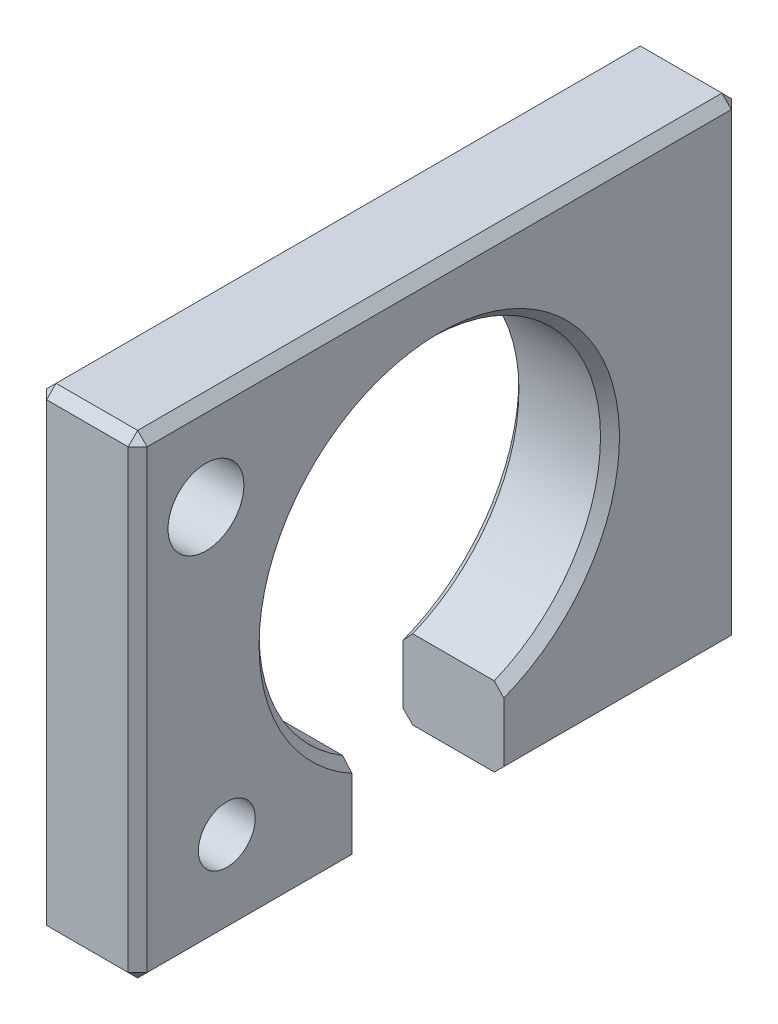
ISO-10303-21;
HEADER;
FILE_DESCRIPTION(('STEP AP214'),'2;1');
FILE_NAME('part.step','',(''),(''),'','','');
FILE_SCHEMA(('AUTOMOTIVE_DESIGN { 1 0 10303 214 1 1 1 1 }'));
ENDSEC;
DATA;
#1=APPLICATION_CONTEXT('core data for automotive mechanical design processes');
#2=APPLICATION_PROTOCOL_DEFINITION('international standard','automotive_design',2000,#1);
#3=PRODUCT_CONTEXT('',#1,'mechanical');
#4=PRODUCT('Part','Part','',(#3));
#5=PRODUCT_RELATED_PRODUCT_CATEGORY('part','',(#4));
#6=PRODUCT_DEFINITION_FORMATION('','',#4);
#7=PRODUCT_DEFINITION_CONTEXT('part definition',#1,'design');
#8=PRODUCT_DEFINITION('design','',#6,#7);
#9=PRODUCT_DEFINITION_SHAPE('','',#8);
#10=(LENGTH_UNIT() NAMED_UNIT(*) SI_UNIT(.MILLI.,.METRE.));
#11=(NAMED_UNIT(*) PLANE_ANGLE_UNIT() SI_UNIT($,.RADIAN.));
#12=(NAMED_UNIT(*) SI_UNIT($,.STERADIAN.) SOLID_ANGLE_UNIT());
#13=UNCERTAINTY_MEASURE_WITH_UNIT(LENGTH_MEASURE(1.E-05),#10,'distance_accuracy_value','');
#14=(GEOMETRIC_REPRESENTATION_CONTEXT(3) GLOBAL_UNCERTAINTY_ASSIGNED_CONTEXT((#13)) GLOBAL_UNIT_ASSIGNED_CONTEXT((#10,
#11,#12)) REPRESENTATION_CONTEXT('',''));
#15=CARTESIAN_POINT('',(0.,0.,0.));
#16=DIRECTION('',(0.,0.,1.));
#17=DIRECTION('',(1.,0.,0.));
#18=AXIS2_PLACEMENT_3D('',#15,#16,#17);
#19=CARTESIAN_POINT('',(2.65,12.5,15.9));
#20=DIRECTION('',(0.,0.,-1.));
#21=DIRECTION('',(-1.,0.,0.));
#22=AXIS2_PLACEMENT_3D('',#19,#20,#21);
#23=PLANE('',#22);
#24=DIRECTION('',(1.,0.,0.));
#25=VECTOR('',#24,1.);
#26=CARTESIAN_POINT('',(2.65,-12.,15.9));
#27=LINE('',#26,#25);
#28=CARTESIAN_POINT('',(-2.15,-12.,15.9));
#29=VERTEX_POINT('',#28);
#30=CARTESIAN_POINT('',(2.15,-12.,15.9));
#31=VERTEX_POINT('',#30);
#32=EDGE_CURVE('E352',#29,#31,#27,.T.);
#33=ORIENTED_EDGE('',*,*,#32,.T.);
#34=DIRECTION('',(0.,1.,0.));
#35=VECTOR('',#34,1.);
#36=CARTESIAN_POINT('',(2.15,12.5,15.9));
#37=LINE('',#36,#35);
#38=CARTESIAN_POINT('',(2.15,12.,15.9));
#39=VERTEX_POINT('',#38);
#40=EDGE_CURVE('E354',#31,#39,#37,.T.);
#41=ORIENTED_EDGE('',*,*,#40,.T.);
#42=DIRECTION('',(-1.,0.,0.));
#43=VECTOR('',#42,1.);
#44=CARTESIAN_POINT('',(2.65,12.,15.9));
#45=LINE('',#44,#43);
#46=CARTESIAN_POINT('',(-2.15,12.,15.9));
#47=VERTEX_POINT('',#46);
#48=EDGE_CURVE('E342',#39,#47,#45,.T.);
#49=ORIENTED_EDGE('',*,*,#48,.T.);
#50=DIRECTION('',(0.,-1.,0.));
#51=VECTOR('',#50,1.);
#52=CARTESIAN_POINT('',(-2.15,12.5,15.9));
#53=LINE('',#52,#51);
#54=EDGE_CURVE('E345',#47,#29,#53,.T.);
#55=ORIENTED_EDGE('',*,*,#54,.T.);
#56=EDGE_LOOP('',(#33,#41,#49,#55));
#57=FACE_BOUND('',#56,.T.);
#58=ADVANCED_FACE('F33',(#57),#23,.F.);
#59=CARTESIAN_POINT('',(2.65,-12.5,15.9));
#60=DIRECTION('',(0.,1.,0.));
#61=DIRECTION('',(0.,0.,1.));
#62=AXIS2_PLACEMENT_3D('',#59,#60,#61);
#63=PLANE('',#62);
#64=DIRECTION('',(-1.,0.,0.));
#65=VECTOR('',#64,1.);
#66=CARTESIAN_POINT('',(2.65,-12.5,4.59999999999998));
#67=LINE('',#66,#65);
#68=CARTESIAN_POINT('',(2.15,-12.5,4.59999999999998));
#69=VERTEX_POINT('',#68);
#70=CARTESIAN_POINT('',(-2.15,-12.5,4.59999999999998));
#71=VERTEX_POINT('',#70);
#72=EDGE_CURVE('E314',#69,#71,#67,.T.);
#73=ORIENTED_EDGE('',*,*,#72,.F.);
#74=DIRECTION('',(0.,0.,1.));
#75=VECTOR('',#74,1.);
#76=CARTESIAN_POINT('',(2.15,-12.5,15.9));
#77=LINE('',#76,#75);
#78=CARTESIAN_POINT('',(2.15,-12.5,15.4));
#79=VERTEX_POINT('',#78);
#80=EDGE_CURVE('E197',#69,#79,#77,.T.);
#81=ORIENTED_EDGE('',*,*,#80,.T.);
#82=DIRECTION('',(-1.,0.,0.));
#83=VECTOR('',#82,1.);
#84=CARTESIAN_POINT('',(2.65,-12.5,15.4));
#85=LINE('',#84,#83);
#86=CARTESIAN_POINT('',(-2.15,-12.5,15.4));
#87=VERTEX_POINT('',#86);
#88=EDGE_CURVE('E359',#79,#87,#85,.T.);
#89=ORIENTED_EDGE('',*,*,#88,.T.);
#90=DIRECTION('',(0.,0.,-1.));
#91=VECTOR('',#90,1.);
#92=CARTESIAN_POINT('',(-2.15,-12.5,15.9));
#93=LINE('',#92,#91);
#94=EDGE_CURVE('E357',#87,#71,#93,.T.);
#95=ORIENTED_EDGE('',*,*,#94,.T.);
#96=EDGE_LOOP('',(#73,#81,#89,#95));
#97=FACE_BOUND('',#96,.T.);
#98=ADVANCED_FACE('F224',(#97),#63,.F.);
#99=CARTESIAN_POINT('',(2.65,-7.73563184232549,4.59999999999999));
#100=DIRECTION('',(0.,0.,1.));
#101=DIRECTION('',(0.,-1.,0.));
#102=AXIS2_PLACEMENT_3D('',#99,#100,#101);
#103=PLANE('',#102);
#104=DIRECTION('',(-1.,0.,0.));
#105=VECTOR('',#104,1.);
#106=CARTESIAN_POINT('',(2.65,-7.7356318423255,4.59999999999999));
#107=LINE('',#106,#105);
#108=CARTESIAN_POINT('',(2.15,-7.7356318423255,4.59999999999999));
#109=VERTEX_POINT('',#108);
#110=CARTESIAN_POINT('',(-2.15,-7.7356318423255,4.59999999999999));
#111=VERTEX_POINT('',#110);
#112=EDGE_CURVE('E311',#109,#111,#107,.T.);
#113=ORIENTED_EDGE('',*,*,#112,.F.);
#114=CARTESIAN_POINT('',(2.15,-7.7356318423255,4.59999999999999));
#115=CARTESIAN_POINT('',(2.23291053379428,-7.83206655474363,4.59999999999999));
#116=CARTESIAN_POINT('',(2.31603247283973,-7.92831788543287,4.59999999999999));
#117=CARTESIAN_POINT('',(2.48269913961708,-8.12045375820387,4.59999999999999));
#118=CARTESIAN_POINT('',(2.5662438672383,-8.21633830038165,4.59999999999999));
#119=CARTESIAN_POINT('',(2.65,-8.31203946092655,4.59999999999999));
#120=B_SPLINE_CURVE_WITH_KNOTS('',3,(#114,#115,#116,#117,#118,#119),.UNSPECIFIED.,.F.,.F.,(4,2,
4),(0.,0.381526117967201,0.763052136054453),.UNSPECIFIED.);
#121=CARTESIAN_POINT('',(2.65,-8.31203946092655,4.59999999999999));
#122=VERTEX_POINT('',#121);
#123=EDGE_CURVE('E191',#109,#122,#120,.T.);
#124=ORIENTED_EDGE('',*,*,#123,.T.);
#125=DIRECTION('',(0.,1.,0.));
#126=VECTOR('',#125,1.);
#127=CARTESIAN_POINT('',(2.65,-7.73563184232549,4.59999999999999));
#128=LINE('',#127,#126);
#129=CARTESIAN_POINT('',(2.65,-12.,4.59999999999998));
#130=VERTEX_POINT('',#129);
#131=EDGE_CURVE('E175',#130,#122,#128,.T.);
#132=ORIENTED_EDGE('',*,*,#131,.F.);
#133=DIRECTION('',(-0.707106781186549,-0.707106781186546,0.));
#134=VECTOR('',#133,1.);
#135=CARTESIAN_POINT('',(2.65,-12.,4.59999999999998));
#136=LINE('',#135,#134);
#137=EDGE_CURVE('E188',#130,#69,#136,.T.);
#138=ORIENTED_EDGE('',*,*,#137,.T.);
#139=ORIENTED_EDGE('',*,*,#72,.T.);
#140=DIRECTION('',(0.707106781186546,-0.707106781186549,0.));
#141=VECTOR('',#140,1.);
#142=CARTESIAN_POINT('',(-2.15,-12.5,4.59999999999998));
#143=LINE('',#142,#141);
#144=CARTESIAN_POINT('',(-2.65,-12.,4.59999999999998));
#145=VERTEX_POINT('',#144);
#146=EDGE_CURVE('E199',#71,#145,#143,.F.);
#147=ORIENTED_EDGE('',*,*,#146,.T.);
#148=DIRECTION('',(0.,1.,0.));
#149=VECTOR('',#148,1.);
#150=CARTESIAN_POINT('',(-2.65,-7.73563184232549,4.59999999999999));
#151=LINE('',#150,#149);
#152=CARTESIAN_POINT('',(-2.65,-8.31203946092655,4.59999999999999));
#153=VERTEX_POINT('',#152);
#154=EDGE_CURVE('E298',#145,#153,#151,.T.);
#155=ORIENTED_EDGE('',*,*,#154,.T.);
#156=CARTESIAN_POINT('',(-2.65,-8.31203946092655,4.59999999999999));
#157=CARTESIAN_POINT('',(-2.5662438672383,-8.21633830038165,4.59999999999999));
#158=CARTESIAN_POINT('',(-2.48269913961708,-8.12045375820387,4.59999999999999));
#159=CARTESIAN_POINT('',(-2.31603247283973,-7.92831788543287,4.59999999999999));
#160=CARTESIAN_POINT('',(-2.23291053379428,-7.83206655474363,4.59999999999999));
#161=CARTESIAN_POINT('',(-2.15,-7.7356318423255,4.59999999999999));
#162=B_SPLINE_CURVE_WITH_KNOTS('',3,(#156,#157,#158,#159,#160,#161),.UNSPECIFIED.,.F.,.F.,(4,2,
4),(0.,0.381526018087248,0.763052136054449),.UNSPECIFIED.);
#163=EDGE_CURVE('E198',#153,#111,#162,.T.);
#164=ORIENTED_EDGE('',*,*,#163,.T.);
#165=EDGE_LOOP('',(#113,#124,#132,#138,#139,#147,#155,#164));
#166=FACE_BOUND('',#165,.T.);
#167=ADVANCED_FACE('F186',(#166),#103,.F.);
#168=CARTESIAN_POINT('',(2.65,0.,0.));
#169=DIRECTION('',(-1.,0.,0.));
#170=DIRECTION('',(0.,0.,1.));
#171=AXIS2_PLACEMENT_3D('',#168,#169,#170);
#172=CYLINDRICAL_SURFACE('',#171,9.);
#173=DIRECTION('',(-1.,0.,0.));
#174=VECTOR('',#173,1.);
#175=CARTESIAN_POINT('',(2.65,-8.33306666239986,-3.40000000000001));
#176=LINE('',#175,#174);
#177=CARTESIAN_POINT('',(2.15,-8.33306666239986,-3.40000000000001));
#178=VERTEX_POINT('',#177);
#179=CARTESIAN_POINT('',(-2.15,-8.33306666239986,-3.40000000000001));
#180=VERTEX_POINT('',#179);
#181=EDGE_CURVE('E308',#178,#180,#176,.T.);
#182=ORIENTED_EDGE('',*,*,#181,.F.);
#183=CARTESIAN_POINT('',(2.15,0.,0.));
#184=DIRECTION('',(1.,0.,0.));
#185=DIRECTION('',(0.,0.,-1.));
#186=AXIS2_PLACEMENT_3D('',#183,#184,#185);
#187=CIRCLE('',#186,9.);
#188=EDGE_CURVE('E202',#178,#109,#187,.T.);
#189=ORIENTED_EDGE('',*,*,#188,.T.);
#190=ORIENTED_EDGE('',*,*,#112,.T.);
#191=CARTESIAN_POINT('',(-2.15,0.,0.));
#192=DIRECTION('',(1.,0.,0.));
#193=DIRECTION('',(0.,0.,-1.));
#194=AXIS2_PLACEMENT_3D('',#191,#192,#193);
#195=CIRCLE('',#194,9.);
#196=EDGE_CURVE('E245',#111,#180,#195,.F.);
#197=ORIENTED_EDGE('',*,*,#196,.T.);
#198=EDGE_LOOP('',(#182,#189,#190,#197));
#199=FACE_BOUND('',#198,.T.);
#200=ADVANCED_FACE('F223',(#199),#172,.F.);
#201=CARTESIAN_POINT('',(2.65,-8.33306666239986,-3.40000000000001));
#202=DIRECTION('',(0.,0.,-1.));
#203=DIRECTION('',(-1.,0.,0.));
#204=AXIS2_PLACEMENT_3D('',#201,#202,#203);
#205=PLANE('',#204);
#206=DIRECTION('',(0.,-1.,0.));
#207=VECTOR('',#206,1.);
#208=CARTESIAN_POINT('',(2.65,-8.33306666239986,-3.40000000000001));
#209=LINE('',#208,#207);
#210=CARTESIAN_POINT('',(2.65,-8.87073841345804,-3.40000000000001));
#211=VERTEX_POINT('',#210);
#212=CARTESIAN_POINT('',(2.65,-12.,-3.40000000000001));
#213=VERTEX_POINT('',#212);
#214=EDGE_CURVE('E192',#211,#213,#209,.T.);
#215=ORIENTED_EDGE('',*,*,#214,.F.);
#216=CARTESIAN_POINT('',(2.65,-8.87073841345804,-3.40000000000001));
#217=CARTESIAN_POINT('',(2.56647781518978,-8.78130207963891,-3.40000000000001));
#218=CARTESIAN_POINT('',(2.48305005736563,-8.69177793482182,-3.40000000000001));
#219=CARTESIAN_POINT('',(2.31638339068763,-8.51255401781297,-3.40000000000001));
#220=CARTESIAN_POINT('',(2.23314448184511,-8.42285424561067,-3.40000000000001));
#221=CARTESIAN_POINT('',(2.15,-8.33306666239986,-3.40000000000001));
#222=B_SPLINE_CURVE_WITH_KNOTS('',3,(#216,#217,#218,#219,#220,#221),.UNSPECIFIED.,.F.,.F.,(4,2,
4),(0.,0.367114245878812,0.734228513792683),.UNSPECIFIED.);
#223=EDGE_CURVE('E239',#211,#178,#222,.T.);
#224=ORIENTED_EDGE('',*,*,#223,.T.);
#225=ORIENTED_EDGE('',*,*,#181,.T.);
#226=CARTESIAN_POINT('',(-2.15,-8.33306666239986,-3.40000000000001));
#227=CARTESIAN_POINT('',(-2.23314448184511,-8.42285424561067,-3.40000000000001));
#228=CARTESIAN_POINT('',(-2.31638339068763,-8.51255401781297,-3.40000000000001));
#229=CARTESIAN_POINT('',(-2.48305005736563,-8.69177793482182,-3.40000000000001));
#230=CARTESIAN_POINT('',(-2.56647781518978,-8.78130207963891,-3.40000000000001));
#231=CARTESIAN_POINT('',(-2.65,-8.87073841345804,-3.40000000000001));
#232=B_SPLINE_CURVE_WITH_KNOTS('',3,(#226,#227,#228,#229,#230,#231),.UNSPECIFIED.,.F.,.F.,(4,2,
4),(0.,0.36711426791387,0.734228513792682),.UNSPECIFIED.);
#233=CARTESIAN_POINT('',(-2.65,-8.87073841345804,-3.40000000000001));
#234=VERTEX_POINT('',#233);
#235=EDGE_CURVE('E246',#180,#234,#232,.T.);
#236=ORIENTED_EDGE('',*,*,#235,.T.);
#237=DIRECTION('',(0.,-1.,0.));
#238=VECTOR('',#237,1.);
#239=CARTESIAN_POINT('',(-2.65,-8.33306666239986,-3.40000000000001));
#240=LINE('',#239,#238);
#241=CARTESIAN_POINT('',(-2.65,-12.,-3.40000000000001));
#242=VERTEX_POINT('',#241);
#243=EDGE_CURVE('E193',#234,#242,#240,.T.);
#244=ORIENTED_EDGE('',*,*,#243,.T.);
#245=DIRECTION('',(-0.707106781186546,0.707106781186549,0.));
#246=VECTOR('',#245,1.);
#247=CARTESIAN_POINT('',(-2.15,-12.5,-3.40000000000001));
#248=LINE('',#247,#246);
#249=CARTESIAN_POINT('',(-2.15,-12.5,-3.40000000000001));
#250=VERTEX_POINT('',#249);
#251=EDGE_CURVE('E324',#242,#250,#248,.F.);
#252=ORIENTED_EDGE('',*,*,#251,.T.);
#253=DIRECTION('',(-1.,0.,0.));
#254=VECTOR('',#253,1.);
#255=CARTESIAN_POINT('',(2.65,-12.5,-3.40000000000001));
#256=LINE('',#255,#254);
#257=CARTESIAN_POINT('',(2.15,-12.5,-3.40000000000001));
#258=VERTEX_POINT('',#257);
#259=EDGE_CURVE('E302',#258,#250,#256,.T.);
#260=ORIENTED_EDGE('',*,*,#259,.F.);
#261=DIRECTION('',(0.707106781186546,0.707106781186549,0.));
#262=VECTOR('',#261,1.);
#263=CARTESIAN_POINT('',(2.65,-12.,-3.40000000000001));
#264=LINE('',#263,#262);
#265=EDGE_CURVE('E325',#258,#213,#264,.T.);
#266=ORIENTED_EDGE('',*,*,#265,.T.);
#267=EDGE_LOOP('',(#215,#224,#225,#236,#244,#252,#260,#266));
#268=FACE_BOUND('',#267,.T.);
#269=ADVANCED_FACE('F251',(#268),#205,.F.);
#270=CARTESIAN_POINT('',(2.65,-12.5,-3.40000000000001));
#271=DIRECTION('',(0.,1.,0.));
#272=DIRECTION('',(0.,0.,1.));
#273=AXIS2_PLACEMENT_3D('',#270,#271,#272);
#274=PLANE('',#273);
#275=DIRECTION('',(1.,0.,0.));
#276=VECTOR('',#275,1.);
#277=CARTESIAN_POINT('',(2.65,-12.5,-15.4));
#278=LINE('',#277,#276);
#279=CARTESIAN_POINT('',(-2.15,-12.5,-15.4));
#280=VERTEX_POINT('',#279);
#281=CARTESIAN_POINT('',(2.15,-12.5,-15.4));
#282=VERTEX_POINT('',#281);
#283=EDGE_CURVE('E42',#280,#282,#278,.T.);
#284=ORIENTED_EDGE('',*,*,#283,.T.);
#285=DIRECTION('',(0.,0.,1.));
#286=VECTOR('',#285,1.);
#287=CARTESIAN_POINT('',(2.15,-12.5,-3.40000000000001));
#288=LINE('',#287,#286);
#289=EDGE_CURVE('E11',#282,#258,#288,.T.);
#290=ORIENTED_EDGE('',*,*,#289,.T.);
#291=ORIENTED_EDGE('',*,*,#259,.T.);
#292=DIRECTION('',(0.,0.,-1.));
#293=VECTOR('',#292,1.);
#294=CARTESIAN_POINT('',(-2.15,-12.5,-3.40000000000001));
#295=LINE('',#294,#293);
#296=EDGE_CURVE('E53',#250,#280,#295,.T.);
#297=ORIENTED_EDGE('',*,*,#296,.T.);
#298=EDGE_LOOP('',(#284,#290,#291,#297));
#299=FACE_BOUND('',#298,.T.);
#300=ADVANCED_FACE('F255',(#299),#274,.F.);
#301=CARTESIAN_POINT('',(2.65,12.5,-15.9));
#302=DIRECTION('',(0.,0.,1.));
#303=DIRECTION('',(1.,0.,0.));
#304=AXIS2_PLACEMENT_3D('',#301,#302,#303);
#305=PLANE('',#304);
#306=DIRECTION('',(0.,-1.,0.));
#307=VECTOR('',#306,1.);
#308=CARTESIAN_POINT('',(2.15,-12.5,-15.9));
#309=LINE('',#308,#307);
#310=CARTESIAN_POINT('',(2.15,12.,-15.9));
#311=VERTEX_POINT('',#310);
#312=CARTESIAN_POINT('',(2.15,-12.,-15.9));
#313=VERTEX_POINT('',#312);
#314=EDGE_CURVE('E375',#311,#313,#309,.T.);
#315=ORIENTED_EDGE('',*,*,#314,.T.);
#316=DIRECTION('',(-1.,0.,0.));
#317=VECTOR('',#316,1.);
#318=CARTESIAN_POINT('',(2.65,-12.,-15.9));
#319=LINE('',#318,#317);
#320=CARTESIAN_POINT('',(-2.15,-12.,-15.9));
#321=VERTEX_POINT('',#320);
#322=EDGE_CURVE('E377',#313,#321,#319,.T.);
#323=ORIENTED_EDGE('',*,*,#322,.T.);
#324=DIRECTION('',(0.,1.,0.));
#325=VECTOR('',#324,1.);
#326=CARTESIAN_POINT('',(-2.15,12.5,-15.9));
#327=LINE('',#326,#325);
#328=CARTESIAN_POINT('',(-2.15,12.,-15.9));
#329=VERTEX_POINT('',#328);
#330=EDGE_CURVE('E371',#321,#329,#327,.T.);
#331=ORIENTED_EDGE('',*,*,#330,.T.);
#332=DIRECTION('',(1.,0.,0.));
#333=VECTOR('',#332,1.);
#334=CARTESIAN_POINT('',(2.65,12.,-15.9));
#335=LINE('',#334,#333);
#336=EDGE_CURVE('E373',#329,#311,#335,.T.);
#337=ORIENTED_EDGE('',*,*,#336,.T.);
#338=EDGE_LOOP('',(#315,#323,#331,#337));
#339=FACE_BOUND('',#338,.T.);
#340=ADVANCED_FACE('F260',(#339),#305,.F.);
#341=CARTESIAN_POINT('',(2.65,12.5,15.9));
#342=DIRECTION('',(0.,-1.,0.));
#343=DIRECTION('',(0.,0.,-1.));
#344=AXIS2_PLACEMENT_3D('',#341,#342,#343);
#345=PLANE('',#344);
#346=DIRECTION('',(1.,0.,0.));
#347=VECTOR('',#346,1.);
#348=CARTESIAN_POINT('',(2.65,12.5,15.4));
#349=LINE('',#348,#347);
#350=CARTESIAN_POINT('',(-2.15,12.5,15.4));
#351=VERTEX_POINT('',#350);
#352=CARTESIAN_POINT('',(2.15,12.5,15.4));
#353=VERTEX_POINT('',#352);
#354=EDGE_CURVE('E366',#351,#353,#349,.T.);
#355=ORIENTED_EDGE('',*,*,#354,.T.);
#356=DIRECTION('',(0.,0.,-1.));
#357=VECTOR('',#356,1.);
#358=CARTESIAN_POINT('',(2.15,12.5,-15.9));
#359=LINE('',#358,#357);
#360=CARTESIAN_POINT('',(2.15,12.5,-15.4));
#361=VERTEX_POINT('',#360);
#362=EDGE_CURVE('E368',#353,#361,#359,.T.);
#363=ORIENTED_EDGE('',*,*,#362,.T.);
#364=DIRECTION('',(-1.,0.,0.));
#365=VECTOR('',#364,1.);
#366=CARTESIAN_POINT('',(2.65,12.5,-15.4));
#367=LINE('',#366,#365);
#368=CARTESIAN_POINT('',(-2.15,12.5,-15.4));
#369=VERTEX_POINT('',#368);
#370=EDGE_CURVE('E362',#361,#369,#367,.T.);
#371=ORIENTED_EDGE('',*,*,#370,.T.);
#372=DIRECTION('',(0.,0.,1.));
#373=VECTOR('',#372,1.);
#374=CARTESIAN_POINT('',(-2.15,12.5,15.9));
#375=LINE('',#374,#373);
#376=EDGE_CURVE('E364',#369,#351,#375,.T.);
#377=ORIENTED_EDGE('',*,*,#376,.T.);
#378=EDGE_LOOP('',(#355,#363,#371,#377));
#379=FACE_BOUND('',#378,.T.);
#380=ADVANCED_FACE('F263',(#379),#345,.F.);
#381=CARTESIAN_POINT('',(2.65,0.,0.));
#382=DIRECTION('',(1.,0.,0.));
#383=DIRECTION('',(0.,0.,-1.));
#384=AXIS2_PLACEMENT_3D('',#381,#382,#383);
#385=PLANE('',#384);
#386=CARTESIAN_POINT('',(2.65,7.7,12.3));
#387=DIRECTION('',(1.,0.,0.));
#388=DIRECTION('',(0.,0.,-1.));
#389=AXIS2_PLACEMENT_3D('',#386,#387,#388);
#390=CIRCLE('',#389,2.);
#391=CARTESIAN_POINT('',(2.65,7.7,10.3));
#392=VERTEX_POINT('',#391);
#393=EDGE_CURVE('E286',#392,#392,#390,.T.);
#394=ORIENTED_EDGE('',*,*,#393,.F.);
#395=EDGE_LOOP('',(#394));
#396=FACE_BOUND('',#395,.T.);
#397=CARTESIAN_POINT('',(2.65,-7.8,11.2));
#398=DIRECTION('',(1.,0.,0.));
#399=DIRECTION('',(0.,0.,-1.));
#400=AXIS2_PLACEMENT_3D('',#397,#398,#399);
#401=CIRCLE('',#400,1.5);
#402=CARTESIAN_POINT('',(2.65,-7.8,9.7));
#403=VERTEX_POINT('',#402);
#404=EDGE_CURVE('E290',#403,#403,#401,.T.);
#405=ORIENTED_EDGE('',*,*,#404,.F.);
#406=EDGE_LOOP('',(#405));
#407=FACE_BOUND('',#406,.T.);
#408=ORIENTED_EDGE('',*,*,#131,.T.);
#409=CARTESIAN_POINT('',(2.65,0.,0.));
#410=DIRECTION('',(1.,0.,0.));
#411=DIRECTION('',(0.,0.,-1.));
#412=AXIS2_PLACEMENT_3D('',#409,#410,#411);
#413=CIRCLE('',#412,9.5);
#414=EDGE_CURVE('E182',#122,#211,#413,.F.);
#415=ORIENTED_EDGE('',*,*,#414,.T.);
#416=ORIENTED_EDGE('',*,*,#214,.T.);
#417=DIRECTION('',(0.,0.,-1.));
#418=VECTOR('',#417,1.);
#419=CARTESIAN_POINT('',(2.65,-12.,-15.9));
#420=LINE('',#419,#418);
#421=CARTESIAN_POINT('',(2.65,-12.,-15.4));
#422=VERTEX_POINT('',#421);
#423=EDGE_CURVE('E318',#213,#422,#420,.T.);
#424=ORIENTED_EDGE('',*,*,#423,.T.);
#425=DIRECTION('',(0.,1.,0.));
#426=VECTOR('',#425,1.);
#427=CARTESIAN_POINT('',(2.65,12.5,-15.4));
#428=LINE('',#427,#426);
#429=CARTESIAN_POINT('',(2.65,12.,-15.4));
#430=VERTEX_POINT('',#429);
#431=EDGE_CURVE('E316',#422,#430,#428,.T.);
#432=ORIENTED_EDGE('',*,*,#431,.T.);
#433=DIRECTION('',(0.,0.,1.));
#434=VECTOR('',#433,1.);
#435=CARTESIAN_POINT('',(2.65,12.,15.9));
#436=LINE('',#435,#434);
#437=CARTESIAN_POINT('',(2.65,12.,15.4));
#438=VERTEX_POINT('',#437);
#439=EDGE_CURVE('E320',#430,#438,#436,.T.);
#440=ORIENTED_EDGE('',*,*,#439,.T.);
#441=DIRECTION('',(0.,-1.,0.));
#442=VECTOR('',#441,1.);
#443=CARTESIAN_POINT('',(2.65,-12.5,15.4));
#444=LINE('',#443,#442);
#445=CARTESIAN_POINT('',(2.65,-12.,15.4));
#446=VERTEX_POINT('',#445);
#447=EDGE_CURVE('E178',#438,#446,#444,.T.);
#448=ORIENTED_EDGE('',*,*,#447,.T.);
#449=DIRECTION('',(0.,0.,-1.));
#450=VECTOR('',#449,1.);
#451=CARTESIAN_POINT('',(2.65,-12.,4.59999999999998));
#452=LINE('',#451,#450);
#453=EDGE_CURVE('E171',#446,#130,#452,.T.);
#454=ORIENTED_EDGE('',*,*,#453,.T.);
#455=EDGE_LOOP('',(#408,#415,#416,#424,#432,#440,#448,#454));
#456=FACE_BOUND('',#455,.T.);
#457=ADVANCED_FACE('F173',(#396,#407,#456),#385,.T.);
#458=CARTESIAN_POINT('',(-2.65,0.,0.));
#459=DIRECTION('',(1.,0.,0.));
#460=DIRECTION('',(0.,0.,-1.));
#461=AXIS2_PLACEMENT_3D('',#458,#459,#460);
#462=PLANE('',#461);
#463=CARTESIAN_POINT('',(-2.65,7.7,12.3));
#464=DIRECTION('',(1.,0.,0.));
#465=DIRECTION('',(0.,0.,-1.));
#466=AXIS2_PLACEMENT_3D('',#463,#464,#465);
#467=CIRCLE('',#466,2.);
#468=CARTESIAN_POINT('',(-2.65,7.7,10.3));
#469=VERTEX_POINT('',#468);
#470=EDGE_CURVE('E289',#469,#469,#467,.F.);
#471=ORIENTED_EDGE('',*,*,#470,.F.);
#472=EDGE_LOOP('',(#471));
#473=FACE_BOUND('',#472,.T.);
#474=CARTESIAN_POINT('',(-2.65,-7.8,11.2));
#475=DIRECTION('',(1.,0.,0.));
#476=DIRECTION('',(0.,0.,-1.));
#477=AXIS2_PLACEMENT_3D('',#474,#475,#476);
#478=CIRCLE('',#477,1.5);
#479=CARTESIAN_POINT('',(-2.65,-7.8,9.7));
#480=VERTEX_POINT('',#479);
#481=EDGE_CURVE('E293',#480,#480,#478,.F.);
#482=ORIENTED_EDGE('',*,*,#481,.F.);
#483=EDGE_LOOP('',(#482));
#484=FACE_BOUND('',#483,.T.);
#485=ORIENTED_EDGE('',*,*,#243,.F.);
#486=CARTESIAN_POINT('',(-2.65,0.,0.));
#487=DIRECTION('',(1.,0.,0.));
#488=DIRECTION('',(0.,0.,-1.));
#489=AXIS2_PLACEMENT_3D('',#486,#487,#488);
#490=CIRCLE('',#489,9.5);
#491=EDGE_CURVE('E338',#234,#153,#490,.T.);
#492=ORIENTED_EDGE('',*,*,#491,.T.);
#493=ORIENTED_EDGE('',*,*,#154,.F.);
#494=DIRECTION('',(0.,0.,1.));
#495=VECTOR('',#494,1.);
#496=CARTESIAN_POINT('',(-2.65,-12.,0.));
#497=LINE('',#496,#495);
#498=CARTESIAN_POINT('',(-2.65,-12.,15.4));
#499=VERTEX_POINT('',#498);
#500=EDGE_CURVE('E343',#145,#499,#497,.T.);
#501=ORIENTED_EDGE('',*,*,#500,.T.);
#502=DIRECTION('',(0.,1.,0.));
#503=VECTOR('',#502,1.);
#504=CARTESIAN_POINT('',(-2.65,0.,15.4));
#505=LINE('',#504,#503);
#506=CARTESIAN_POINT('',(-2.65,12.,15.4));
#507=VERTEX_POINT('',#506);
#508=EDGE_CURVE('E347',#499,#507,#505,.T.);
#509=ORIENTED_EDGE('',*,*,#508,.T.);
#510=DIRECTION('',(0.,0.,-1.));
#511=VECTOR('',#510,1.);
#512=CARTESIAN_POINT('',(-2.65,12.,0.));
#513=LINE('',#512,#511);
#514=CARTESIAN_POINT('',(-2.65,12.,-15.4));
#515=VERTEX_POINT('',#514);
#516=EDGE_CURVE('E455',#507,#515,#513,.T.);
#517=ORIENTED_EDGE('',*,*,#516,.T.);
#518=DIRECTION('',(0.,-1.,0.));
#519=VECTOR('',#518,1.);
#520=CARTESIAN_POINT('',(-2.65,0.,-15.4));
#521=LINE('',#520,#519);
#522=CARTESIAN_POINT('',(-2.65,-12.,-15.4));
#523=VERTEX_POINT('',#522);
#524=EDGE_CURVE('E454',#515,#523,#521,.T.);
#525=ORIENTED_EDGE('',*,*,#524,.T.);
#526=DIRECTION('',(0.,0.,1.));
#527=VECTOR('',#526,1.);
#528=CARTESIAN_POINT('',(-2.65,-12.,0.));
#529=LINE('',#528,#527);
#530=EDGE_CURVE('E340',#523,#242,#529,.T.);
#531=ORIENTED_EDGE('',*,*,#530,.T.);
#532=EDGE_LOOP('',(#485,#492,#493,#501,#509,#517,#525,#531));
#533=FACE_BOUND('',#532,.T.);
#534=ADVANCED_FACE('F268',(#473,#484,#533),#462,.F.);
#535=CARTESIAN_POINT('',(-2.651,-7.8,11.2));
#536=DIRECTION('',(1.,0.,0.));
#537=DIRECTION('',(0.,0.,-1.));
#538=AXIS2_PLACEMENT_3D('',#535,#536,#537);
#539=CYLINDRICAL_SURFACE('',#538,1.5);
#540=CARTESIAN_POINT('',(2.65,-7.8,9.7));
#541=CARTESIAN_POINT('',(2.59479166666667,-7.8,9.7));
#542=CARTESIAN_POINT('',(2.53958333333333,-7.8,9.7));
#543=CARTESIAN_POINT('',(2.42916666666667,-7.8,9.7));
#544=CARTESIAN_POINT('',(2.37395833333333,-7.8,9.7));
#545=CARTESIAN_POINT('',(2.26354166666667,-7.8,9.7));
#546=CARTESIAN_POINT('',(2.20833333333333,-7.8,9.7));
#547=CARTESIAN_POINT('',(2.09791666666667,-7.8,9.7));
#548=CARTESIAN_POINT('',(2.04270833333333,-7.8,9.7));
#549=CARTESIAN_POINT('',(1.93229166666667,-7.8,9.7));
#550=CARTESIAN_POINT('',(1.87708333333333,-7.8,9.7));
#551=CARTESIAN_POINT('',(1.76666666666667,-7.8,9.7));
#552=CARTESIAN_POINT('',(1.71145833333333,-7.8,9.7));
#553=CARTESIAN_POINT('',(1.60104166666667,-7.8,9.7));
#554=CARTESIAN_POINT('',(1.54583333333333,-7.8,9.7));
#555=CARTESIAN_POINT('',(1.43541666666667,-7.8,9.7));
#556=CARTESIAN_POINT('',(1.38020833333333,-7.8,9.7));
#557=CARTESIAN_POINT('',(1.26979166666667,-7.8,9.7));
#558=CARTESIAN_POINT('',(1.21458333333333,-7.8,9.7));
#559=CARTESIAN_POINT('',(1.10416666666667,-7.8,9.7));
#560=CARTESIAN_POINT('',(1.04895833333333,-7.8,9.7));
#561=CARTESIAN_POINT('',(0.938541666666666,-7.8,9.7));
#562=CARTESIAN_POINT('',(0.883333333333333,-7.8,9.7));
#563=CARTESIAN_POINT('',(0.772916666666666,-7.8,9.7));
#564=CARTESIAN_POINT('',(0.717708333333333,-7.8,9.7));
#565=CARTESIAN_POINT('',(0.607291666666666,-7.8,9.7));
#566=CARTESIAN_POINT('',(0.552083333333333,-7.8,9.7));
#567=CARTESIAN_POINT('',(0.441666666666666,-7.8,9.7));
#568=CARTESIAN_POINT('',(0.386458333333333,-7.8,9.7));
#569=CARTESIAN_POINT('',(0.276041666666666,-7.8,9.7));
#570=CARTESIAN_POINT('',(0.220833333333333,-7.8,9.7));
#571=CARTESIAN_POINT('',(0.110416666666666,-7.8,9.7));
#572=CARTESIAN_POINT('',(0.0552083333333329,-7.8,9.7));
#573=CARTESIAN_POINT('',(-0.0552083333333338,-7.8,9.7));
#574=CARTESIAN_POINT('',(-0.110416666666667,-7.8,9.7));
#575=CARTESIAN_POINT('',(-0.220833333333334,-7.8,9.7));
#576=CARTESIAN_POINT('',(-0.276041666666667,-7.8,9.7));
#577=CARTESIAN_POINT('',(-0.386458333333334,-7.8,9.7));
#578=CARTESIAN_POINT('',(-0.441666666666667,-7.8,9.7));
#579=CARTESIAN_POINT('',(-0.552083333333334,-7.8,9.7));
#580=CARTESIAN_POINT('',(-0.607291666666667,-7.8,9.7));
#581=CARTESIAN_POINT('',(-0.717708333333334,-7.8,9.7));
#582=CARTESIAN_POINT('',(-0.772916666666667,-7.8,9.7));
#583=CARTESIAN_POINT('',(-0.883333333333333,-7.8,9.7));
#584=CARTESIAN_POINT('',(-0.938541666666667,-7.8,9.7));
#585=CARTESIAN_POINT('',(-1.04895833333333,-7.8,9.7));
#586=CARTESIAN_POINT('',(-1.10416666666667,-7.8,9.7));
#587=CARTESIAN_POINT('',(-1.21458333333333,-7.8,9.7));
#588=CARTESIAN_POINT('',(-1.26979166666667,-7.8,9.7));
#589=CARTESIAN_POINT('',(-1.38020833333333,-7.8,9.7));
#590=CARTESIAN_POINT('',(-1.43541666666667,-7.8,9.7));
#591=CARTESIAN_POINT('',(-1.54583333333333,-7.8,9.7));
#592=CARTESIAN_POINT('',(-1.60104166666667,-7.8,9.7));
#593=CARTESIAN_POINT('',(-1.71145833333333,-7.8,9.7));
#594=CARTESIAN_POINT('',(-1.76666666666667,-7.8,9.7));
#595=CARTESIAN_POINT('',(-1.87708333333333,-7.8,9.7));
#596=CARTESIAN_POINT('',(-1.93229166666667,-7.8,9.7));
#597=CARTESIAN_POINT('',(-2.04270833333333,-7.8,9.7));
#598=CARTESIAN_POINT('',(-2.09791666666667,-7.8,9.7));
#599=CARTESIAN_POINT('',(-2.20833333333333,-7.8,9.7));
#600=CARTESIAN_POINT('',(-2.26354166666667,-7.8,9.7));
#601=CARTESIAN_POINT('',(-2.37395833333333,-7.8,9.7));
#602=CARTESIAN_POINT('',(-2.42916666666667,-7.8,9.7));
#603=CARTESIAN_POINT('',(-2.53958333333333,-7.8,9.7));
#604=CARTESIAN_POINT('',(-2.59479166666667,-7.8,9.7));
#605=CARTESIAN_POINT('',(-2.65,-7.8,9.7));
#606=B_SPLINE_CURVE_WITH_KNOTS('',3,(#540,#541,#542,#543,#544,#545,#546,#547,#548,#549,#550,
#551,#552,#553,#554,#555,#556,#557,#558,#559,#560,#561,#562,#563,#564,#565,#566,#567,#568,#569,
#570,#571,#572,#573,#574,#575,#576,#577,#578,#579,#580,#581,#582,#583,#584,#585,#586,#587,#588,
#589,#590,#591,#592,#593,#594,#595,#596,#597,#598,#599,#600,#601,#602,#603,#604,#605),
.UNSPECIFIED.,.F.,.F.,(4,2,2,2,2,2,2,2,2,2,2,2,2,2,2,2,2,2,2,2,2,2,2,2,2,2,2,2,2,2,2,2,4),(0.,
0.165625,0.33125,0.496875,0.6625,0.828125,0.99375,1.159375,1.325,1.490625,1.65625,1.821875,
1.9875,2.153125,2.31875,2.484375,2.65,2.815625,2.98125,3.146875,3.3125,3.478125,3.64375,
3.809375,3.975,4.140625,4.30625,4.471875,4.6375,4.803125,4.96875,5.134375,5.3),.UNSPECIFIED.);
#607=EDGE_CURVE('BSEAM271',#403,#480,#606,.T.);
#608=ORIENTED_EDGE('',*,*,#404,.T.);
#609=ORIENTED_EDGE('',*,*,#481,.T.);
#610=ORIENTED_EDGE('',*,*,#607,.T.);
#611=ORIENTED_EDGE('',*,*,#607,.F.);
#612=EDGE_LOOP('',(#608,#610,#609,#611));
#613=FACE_BOUND('',#612,.T.);
#614=ADVANCED_FACE('F271',(#613),#539,.F.);
#615=CARTESIAN_POINT('',(-2.651,7.7,12.3));
#616=DIRECTION('',(1.,0.,0.));
#617=DIRECTION('',(0.,0.,-1.));
#618=AXIS2_PLACEMENT_3D('',#615,#616,#617);
#619=CYLINDRICAL_SURFACE('',#618,2.);
#620=CARTESIAN_POINT('',(2.65,7.7,10.3));
#621=CARTESIAN_POINT('',(2.59479166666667,7.7,10.3));
#622=CARTESIAN_POINT('',(2.53958333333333,7.7,10.3));
#623=CARTESIAN_POINT('',(2.42916666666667,7.7,10.3));
#624=CARTESIAN_POINT('',(2.37395833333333,7.7,10.3));
#625=CARTESIAN_POINT('',(2.26354166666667,7.7,10.3));
#626=CARTESIAN_POINT('',(2.20833333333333,7.7,10.3));
#627=CARTESIAN_POINT('',(2.09791666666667,7.7,10.3));
#628=CARTESIAN_POINT('',(2.04270833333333,7.7,10.3));
#629=CARTESIAN_POINT('',(1.93229166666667,7.7,10.3));
#630=CARTESIAN_POINT('',(1.87708333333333,7.7,10.3));
#631=CARTESIAN_POINT('',(1.76666666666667,7.7,10.3));
#632=CARTESIAN_POINT('',(1.71145833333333,7.7,10.3));
#633=CARTESIAN_POINT('',(1.60104166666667,7.7,10.3));
#634=CARTESIAN_POINT('',(1.54583333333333,7.7,10.3));
#635=CARTESIAN_POINT('',(1.43541666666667,7.7,10.3));
#636=CARTESIAN_POINT('',(1.38020833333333,7.7,10.3));
#637=CARTESIAN_POINT('',(1.26979166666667,7.7,10.3));
#638=CARTESIAN_POINT('',(1.21458333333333,7.7,10.3));
#639=CARTESIAN_POINT('',(1.10416666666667,7.7,10.3));
#640=CARTESIAN_POINT('',(1.04895833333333,7.7,10.3));
#641=CARTESIAN_POINT('',(0.938541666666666,7.7,10.3));
#642=CARTESIAN_POINT('',(0.883333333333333,7.7,10.3));
#643=CARTESIAN_POINT('',(0.772916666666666,7.7,10.3));
#644=CARTESIAN_POINT('',(0.717708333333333,7.7,10.3));
#645=CARTESIAN_POINT('',(0.607291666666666,7.7,10.3));
#646=CARTESIAN_POINT('',(0.552083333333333,7.7,10.3));
#647=CARTESIAN_POINT('',(0.441666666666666,7.7,10.3));
#648=CARTESIAN_POINT('',(0.386458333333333,7.7,10.3));
#649=CARTESIAN_POINT('',(0.276041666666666,7.7,10.3));
#650=CARTESIAN_POINT('',(0.220833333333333,7.7,10.3));
#651=CARTESIAN_POINT('',(0.110416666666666,7.7,10.3));
#652=CARTESIAN_POINT('',(0.0552083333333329,7.7,10.3));
#653=CARTESIAN_POINT('',(-0.0552083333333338,7.7,10.3));
#654=CARTESIAN_POINT('',(-0.110416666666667,7.7,10.3));
#655=CARTESIAN_POINT('',(-0.220833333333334,7.7,10.3));
#656=CARTESIAN_POINT('',(-0.276041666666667,7.7,10.3));
#657=CARTESIAN_POINT('',(-0.386458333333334,7.7,10.3));
#658=CARTESIAN_POINT('',(-0.441666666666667,7.7,10.3));
#659=CARTESIAN_POINT('',(-0.552083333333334,7.7,10.3));
#660=CARTESIAN_POINT('',(-0.607291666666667,7.7,10.3));
#661=CARTESIAN_POINT('',(-0.717708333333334,7.7,10.3));
#662=CARTESIAN_POINT('',(-0.772916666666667,7.7,10.3));
#663=CARTESIAN_POINT('',(-0.883333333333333,7.7,10.3));
#664=CARTESIAN_POINT('',(-0.938541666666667,7.7,10.3));
#665=CARTESIAN_POINT('',(-1.04895833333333,7.7,10.3));
#666=CARTESIAN_POINT('',(-1.10416666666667,7.7,10.3));
#667=CARTESIAN_POINT('',(-1.21458333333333,7.7,10.3));
#668=CARTESIAN_POINT('',(-1.26979166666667,7.7,10.3));
#669=CARTESIAN_POINT('',(-1.38020833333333,7.7,10.3));
#670=CARTESIAN_POINT('',(-1.43541666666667,7.7,10.3));
#671=CARTESIAN_POINT('',(-1.54583333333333,7.7,10.3));
#672=CARTESIAN_POINT('',(-1.60104166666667,7.7,10.3));
#673=CARTESIAN_POINT('',(-1.71145833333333,7.7,10.3));
#674=CARTESIAN_POINT('',(-1.76666666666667,7.7,10.3));
#675=CARTESIAN_POINT('',(-1.87708333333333,7.7,10.3));
#676=CARTESIAN_POINT('',(-1.93229166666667,7.7,10.3));
#677=CARTESIAN_POINT('',(-2.04270833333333,7.7,10.3));
#678=CARTESIAN_POINT('',(-2.09791666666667,7.7,10.3));
#679=CARTESIAN_POINT('',(-2.20833333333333,7.7,10.3));
#680=CARTESIAN_POINT('',(-2.26354166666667,7.7,10.3));
#681=CARTESIAN_POINT('',(-2.37395833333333,7.7,10.3));
#682=CARTESIAN_POINT('',(-2.42916666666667,7.7,10.3));
#683=CARTESIAN_POINT('',(-2.53958333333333,7.7,10.3));
#684=CARTESIAN_POINT('',(-2.59479166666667,7.7,10.3));
#685=CARTESIAN_POINT('',(-2.65,7.7,10.3));
#686=B_SPLINE_CURVE_WITH_KNOTS('',3,(#620,#621,#622,#623,#624,#625,#626,#627,#628,#629,#630,
#631,#632,#633,#634,#635,#636,#637,#638,#639,#640,#641,#642,#643,#644,#645,#646,#647,#648,#649,
#650,#651,#652,#653,#654,#655,#656,#657,#658,#659,#660,#661,#662,#663,#664,#665,#666,#667,#668,
#669,#670,#671,#672,#673,#674,#675,#676,#677,#678,#679,#680,#681,#682,#683,#684,#685),
.UNSPECIFIED.,.F.,.F.,(4,2,2,2,2,2,2,2,2,2,2,2,2,2,2,2,2,2,2,2,2,2,2,2,2,2,2,2,2,2,2,2,4),(0.,
0.165625,0.33125,0.496875,0.6625,0.828125,0.99375,1.159375,1.325,1.490625,1.65625,1.821875,
1.9875,2.153125,2.31875,2.484375,2.65,2.815625,2.98125,3.146875,3.3125,3.478125,3.64375,
3.809375,3.975,4.140625,4.30625,4.471875,4.6375,4.803125,4.96875,5.134375,5.3),.UNSPECIFIED.);
#687=EDGE_CURVE('BSEAM235',#392,#469,#686,.T.);
#688=ORIENTED_EDGE('',*,*,#393,.T.);
#689=ORIENTED_EDGE('',*,*,#470,.T.);
#690=ORIENTED_EDGE('',*,*,#687,.T.);
#691=ORIENTED_EDGE('',*,*,#687,.F.);
#692=EDGE_LOOP('',(#688,#690,#689,#691));
#693=FACE_BOUND('',#692,.T.);
#694=ADVANCED_FACE('F235',(#693),#619,.F.);
#695=CARTESIAN_POINT('',(2.65,0.,0.));
#696=DIRECTION('',(1.,0.,0.));
#697=DIRECTION('',(0.,0.,-1.));
#698=AXIS2_PLACEMENT_3D('',#695,#696,#697);
#699=CONICAL_SURFACE('',#698,9.5,0.785398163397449);
#700=ORIENTED_EDGE('',*,*,#123,.F.);
#701=ORIENTED_EDGE('',*,*,#188,.F.);
#702=ORIENTED_EDGE('',*,*,#223,.F.);
#703=ORIENTED_EDGE('',*,*,#414,.F.);
#704=EDGE_LOOP('',(#700,#701,#702,#703));
#705=FACE_BOUND('',#704,.T.);
#706=ADVANCED_FACE('F232',(#705),#699,.F.);
#707=CARTESIAN_POINT('',(-2.15,0.,0.));
#708=DIRECTION('',(-1.,0.,0.));
#709=DIRECTION('',(0.,0.,1.));
#710=AXIS2_PLACEMENT_3D('',#707,#708,#709);
#711=CONICAL_SURFACE('',#710,9.,0.785398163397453);
#712=ORIENTED_EDGE('',*,*,#163,.F.);
#713=ORIENTED_EDGE('',*,*,#491,.F.);
#714=ORIENTED_EDGE('',*,*,#235,.F.);
#715=ORIENTED_EDGE('',*,*,#196,.F.);
#716=EDGE_LOOP('',(#712,#713,#714,#715));
#717=FACE_BOUND('',#716,.T.);
#718=ADVANCED_FACE('F216',(#717),#711,.F.);
#719=CARTESIAN_POINT('',(-2.15,-12.5,-3.40000000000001));
#720=DIRECTION('',(0.707106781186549,0.707106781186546,0.));
#721=DIRECTION('',(-0.707106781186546,0.707106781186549,0.));
#722=AXIS2_PLACEMENT_3D('',#719,#720,#721);
#723=PLANE('',#722);
#724=DIRECTION('',(0.707106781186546,-0.707106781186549,0.));
#725=VECTOR('',#724,1.);
#726=CARTESIAN_POINT('',(-2.4,-12.25,-15.4));
#727=LINE('',#726,#725);
#728=EDGE_CURVE('E37',#280,#523,#727,.F.);
#729=ORIENTED_EDGE('',*,*,#728,.F.);
#730=ORIENTED_EDGE('',*,*,#296,.F.);
#731=ORIENTED_EDGE('',*,*,#251,.F.);
#732=ORIENTED_EDGE('',*,*,#530,.F.);
#733=EDGE_LOOP('',(#729,#730,#731,#732));
#734=FACE_BOUND('',#733,.T.);
#735=ADVANCED_FACE('F35',(#734),#723,.F.);
#736=CARTESIAN_POINT('',(-2.15,-12.,-15.9));
#737=DIRECTION('',(-0.577350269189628,-0.577350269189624,-0.577350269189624));
#738=DIRECTION('',(-0.707106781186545,0.,0.70710678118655));
#739=AXIS2_PLACEMENT_3D('',#736,#737,#738);
#740=PLANE('',#739);
#741=DIRECTION('',(0.,0.707106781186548,-0.707106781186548));
#742=VECTOR('',#741,1.);
#743=CARTESIAN_POINT('',(-2.15,-12.,-15.9));
#744=LINE('',#743,#742);
#745=EDGE_CURVE('E442',#280,#321,#744,.T.);
#746=ORIENTED_EDGE('',*,*,#745,.F.);
#747=ORIENTED_EDGE('',*,*,#728,.T.);
#748=DIRECTION('',(-0.707106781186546,0.,0.707106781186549));
#749=VECTOR('',#748,1.);
#750=CARTESIAN_POINT('',(-2.15,-12.,-15.9));
#751=LINE('',#750,#749);
#752=EDGE_CURVE('E444',#321,#523,#751,.T.);
#753=ORIENTED_EDGE('',*,*,#752,.F.);
#754=EDGE_LOOP('',(#746,#747,#753));
#755=FACE_BOUND('',#754,.T.);
#756=ADVANCED_FACE('F452',(#755),#740,.T.);
#757=CARTESIAN_POINT('',(-2.15,12.5,-15.9));
#758=DIRECTION('',(0.707106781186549,0.,0.707106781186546));
#759=DIRECTION('',(0.707106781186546,0.,-0.707106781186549));
#760=AXIS2_PLACEMENT_3D('',#757,#758,#759);
#761=PLANE('',#760);
#762=ORIENTED_EDGE('',*,*,#752,.T.);
#763=ORIENTED_EDGE('',*,*,#524,.F.);
#764=DIRECTION('',(0.707106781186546,0.,-0.707106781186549));
#765=VECTOR('',#764,1.);
#766=CARTESIAN_POINT('',(-2.65,12.,-15.4));
#767=LINE('',#766,#765);
#768=EDGE_CURVE('E439',#329,#515,#767,.F.);
#769=ORIENTED_EDGE('',*,*,#768,.F.);
#770=ORIENTED_EDGE('',*,*,#330,.F.);
#771=EDGE_LOOP('',(#762,#763,#769,#770));
#772=FACE_BOUND('',#771,.T.);
#773=ADVANCED_FACE('F499',(#772),#761,.F.);
#774=CARTESIAN_POINT('',(2.65,-12.,-15.9));
#775=DIRECTION('',(0.,0.707106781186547,0.707106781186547));
#776=DIRECTION('',(0.,-0.707106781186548,0.707106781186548));
#777=AXIS2_PLACEMENT_3D('',#774,#775,#776);
#778=PLANE('',#777);
#779=ORIENTED_EDGE('',*,*,#745,.T.);
#780=ORIENTED_EDGE('',*,*,#322,.F.);
#781=DIRECTION('',(0.,-0.707106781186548,0.707106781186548));
#782=VECTOR('',#781,1.);
#783=CARTESIAN_POINT('',(2.15,-12.5,-15.4));
#784=LINE('',#783,#782);
#785=EDGE_CURVE('E436',#282,#313,#784,.F.);
#786=ORIENTED_EDGE('',*,*,#785,.F.);
#787=ORIENTED_EDGE('',*,*,#283,.F.);
#788=EDGE_LOOP('',(#779,#780,#786,#787));
#789=FACE_BOUND('',#788,.T.);
#790=ADVANCED_FACE('F504',(#789),#778,.F.);
#791=CARTESIAN_POINT('',(2.65,-12.,0.));
#792=DIRECTION('',(0.707106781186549,-0.707106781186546,0.));
#793=DIRECTION('',(0.707106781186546,0.707106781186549,0.));
#794=AXIS2_PLACEMENT_3D('',#791,#792,#793);
#795=PLANE('',#794);
#796=ORIENTED_EDGE('',*,*,#265,.F.);
#797=ORIENTED_EDGE('',*,*,#289,.F.);
#798=DIRECTION('',(-0.707106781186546,-0.707106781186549,0.));
#799=VECTOR('',#798,1.);
#800=CARTESIAN_POINT('',(2.15,-12.5,-15.4));
#801=LINE('',#800,#799);
#802=EDGE_CURVE('E433',#422,#282,#801,.T.);
#803=ORIENTED_EDGE('',*,*,#802,.F.);
#804=ORIENTED_EDGE('',*,*,#423,.F.);
#805=EDGE_LOOP('',(#796,#797,#803,#804));
#806=FACE_BOUND('',#805,.T.);
#807=ADVANCED_FACE('F514',(#806),#795,.T.);
#808=CARTESIAN_POINT('',(-2.65,12.,-15.4));
#809=DIRECTION('',(-0.577350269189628,0.577350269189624,-0.577350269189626));
#810=DIRECTION('',(-0.707106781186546,0.,0.707106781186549));
#811=AXIS2_PLACEMENT_3D('',#808,#809,#810);
#812=PLANE('',#811);
#813=DIRECTION('',(0.,0.707106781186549,0.707106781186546));
#814=VECTOR('',#813,1.);
#815=CARTESIAN_POINT('',(-2.15,12.25,-15.65));
#816=LINE('',#815,#814);
#817=EDGE_CURVE('E427',#329,#369,#816,.T.);
#818=ORIENTED_EDGE('',*,*,#817,.F.);
#819=ORIENTED_EDGE('',*,*,#768,.T.);
#820=DIRECTION('',(-0.707106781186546,-0.707106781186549,0.));
#821=VECTOR('',#820,1.);
#822=CARTESIAN_POINT('',(-2.65,12.,-15.4));
#823=LINE('',#822,#821);
#824=EDGE_CURVE('E430',#369,#515,#823,.T.);
#825=ORIENTED_EDGE('',*,*,#824,.F.);
#826=EDGE_LOOP('',(#818,#819,#825));
#827=FACE_BOUND('',#826,.T.);
#828=ADVANCED_FACE('F497',(#827),#812,.T.);
#829=CARTESIAN_POINT('',(2.15,-12.5,-15.4));
#830=DIRECTION('',(0.577350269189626,-0.577350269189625,-0.577350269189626));
#831=DIRECTION('',(-0.707106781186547,0.,-0.707106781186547));
#832=AXIS2_PLACEMENT_3D('',#829,#830,#831);
#833=PLANE('',#832);
#834=ORIENTED_EDGE('',*,*,#802,.T.);
#835=ORIENTED_EDGE('',*,*,#785,.T.);
#836=DIRECTION('',(0.707106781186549,0.,0.707106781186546));
#837=VECTOR('',#836,1.);
#838=CARTESIAN_POINT('',(2.4,-12.,-15.65));
#839=LINE('',#838,#837);
#840=EDGE_CURVE('E424',#422,#313,#839,.F.);
#841=ORIENTED_EDGE('',*,*,#840,.F.);
#842=EDGE_LOOP('',(#834,#835,#841));
#843=FACE_BOUND('',#842,.T.);
#844=ADVANCED_FACE('F507',(#843),#833,.T.);
#845=CARTESIAN_POINT('',(-2.15,12.5,15.9));
#846=DIRECTION('',(0.707106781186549,-0.707106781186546,0.));
#847=DIRECTION('',(0.707106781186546,0.707106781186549,0.));
#848=AXIS2_PLACEMENT_3D('',#845,#846,#847);
#849=PLANE('',#848);
#850=ORIENTED_EDGE('',*,*,#824,.T.);
#851=ORIENTED_EDGE('',*,*,#516,.F.);
#852=DIRECTION('',(0.707106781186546,0.707106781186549,0.));
#853=VECTOR('',#852,1.);
#854=CARTESIAN_POINT('',(-2.65,12.,15.4));
#855=LINE('',#854,#853);
#856=EDGE_CURVE('E418',#351,#507,#855,.F.);
#857=ORIENTED_EDGE('',*,*,#856,.F.);
#858=ORIENTED_EDGE('',*,*,#376,.F.);
#859=EDGE_LOOP('',(#850,#851,#857,#858));
#860=FACE_BOUND('',#859,.T.);
#861=ADVANCED_FACE('F467',(#860),#849,.F.);
#862=CARTESIAN_POINT('',(2.65,12.5,-15.4));
#863=DIRECTION('',(0.,-0.707106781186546,0.707106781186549));
#864=DIRECTION('',(0.,-0.707106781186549,-0.707106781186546));
#865=AXIS2_PLACEMENT_3D('',#862,#863,#864);
#866=PLANE('',#865);
#867=ORIENTED_EDGE('',*,*,#817,.T.);
#868=ORIENTED_EDGE('',*,*,#370,.F.);
#869=DIRECTION('',(0.,-0.707106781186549,-0.707106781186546));
#870=VECTOR('',#869,1.);
#871=CARTESIAN_POINT('',(2.15,12.5,-15.4));
#872=LINE('',#871,#870);
#873=EDGE_CURVE('E415',#311,#361,#872,.F.);
#874=ORIENTED_EDGE('',*,*,#873,.F.);
#875=ORIENTED_EDGE('',*,*,#336,.F.);
#876=EDGE_LOOP('',(#867,#868,#874,#875));
#877=FACE_BOUND('',#876,.T.);
#878=ADVANCED_FACE('F494',(#877),#866,.F.);
#879=CARTESIAN_POINT('',(2.65,0.,-15.4));
#880=DIRECTION('',(0.707106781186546,0.,-0.707106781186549));
#881=DIRECTION('',(-0.707106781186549,0.,-0.707106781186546));
#882=AXIS2_PLACEMENT_3D('',#879,#880,#881);
#883=PLANE('',#882);
#884=ORIENTED_EDGE('',*,*,#840,.T.);
#885=ORIENTED_EDGE('',*,*,#314,.F.);
#886=DIRECTION('',(-0.707106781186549,0.,-0.707106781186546));
#887=VECTOR('',#886,1.);
#888=CARTESIAN_POINT('',(2.4,12.,-15.65));
#889=LINE('',#888,#887);
#890=EDGE_CURVE('E412',#430,#311,#889,.T.);
#891=ORIENTED_EDGE('',*,*,#890,.F.);
#892=ORIENTED_EDGE('',*,*,#431,.F.);
#893=EDGE_LOOP('',(#884,#885,#891,#892));
#894=FACE_BOUND('',#893,.T.);
#895=ADVANCED_FACE('F511',(#894),#883,.T.);
#896=CARTESIAN_POINT('',(-2.15,-12.5,15.9));
#897=DIRECTION('',(0.707106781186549,0.707106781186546,0.));
#898=DIRECTION('',(-0.707106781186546,0.707106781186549,0.));
#899=AXIS2_PLACEMENT_3D('',#896,#897,#898);
#900=PLANE('',#899);
#901=ORIENTED_EDGE('',*,*,#146,.F.);
#902=ORIENTED_EDGE('',*,*,#94,.F.);
#903=DIRECTION('',(-0.707106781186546,0.707106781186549,0.));
#904=VECTOR('',#903,1.);
#905=CARTESIAN_POINT('',(-2.15,-12.5,15.4));
#906=LINE('',#905,#904);
#907=EDGE_CURVE('E409',#499,#87,#906,.F.);
#908=ORIENTED_EDGE('',*,*,#907,.F.);
#909=ORIENTED_EDGE('',*,*,#500,.F.);
#910=EDGE_LOOP('',(#901,#902,#908,#909));
#911=FACE_BOUND('',#910,.T.);
#912=ADVANCED_FACE('F618',(#911),#900,.F.);
#913=CARTESIAN_POINT('',(-2.15,12.5,15.9));
#914=DIRECTION('',(0.707106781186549,0.,-0.707106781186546));
#915=DIRECTION('',(-0.707106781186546,0.,-0.707106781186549));
#916=AXIS2_PLACEMENT_3D('',#913,#914,#915);
#917=PLANE('',#916);
#918=DIRECTION('',(-0.707106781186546,0.,-0.707106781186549));
#919=VECTOR('',#918,1.);
#920=CARTESIAN_POINT('',(-2.65,12.,15.4));
#921=LINE('',#920,#919);
#922=EDGE_CURVE('E421',#507,#47,#921,.F.);
#923=ORIENTED_EDGE('',*,*,#922,.F.);
#924=ORIENTED_EDGE('',*,*,#508,.F.);
#925=DIRECTION('',(0.707106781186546,0.,0.707106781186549));
#926=VECTOR('',#925,1.);
#927=CARTESIAN_POINT('',(-2.4,-12.,15.65));
#928=LINE('',#927,#926);
#929=EDGE_CURVE('E406',#29,#499,#928,.F.);
#930=ORIENTED_EDGE('',*,*,#929,.F.);
#931=ORIENTED_EDGE('',*,*,#54,.F.);
#932=EDGE_LOOP('',(#923,#924,#930,#931));
#933=FACE_BOUND('',#932,.T.);
#934=ADVANCED_FACE('F472',(#933),#917,.F.);
#935=CARTESIAN_POINT('',(-2.65,12.,15.4));
#936=DIRECTION('',(-0.577350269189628,0.577350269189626,0.577350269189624));
#937=DIRECTION('',(-0.707106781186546,-0.707106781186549,0.));
#938=AXIS2_PLACEMENT_3D('',#935,#936,#937);
#939=PLANE('',#938);
#940=ORIENTED_EDGE('',*,*,#856,.T.);
#941=ORIENTED_EDGE('',*,*,#922,.T.);
#942=DIRECTION('',(0.,-0.707106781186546,0.707106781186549));
#943=VECTOR('',#942,1.);
#944=CARTESIAN_POINT('',(-2.15,12.25,15.65));
#945=LINE('',#944,#943);
#946=EDGE_CURVE('E403',#351,#47,#945,.T.);
#947=ORIENTED_EDGE('',*,*,#946,.F.);
#948=EDGE_LOOP('',(#940,#941,#947));
#949=FACE_BOUND('',#948,.T.);
#950=ADVANCED_FACE('F474',(#949),#939,.T.);
#951=CARTESIAN_POINT('',(2.15,12.5,-15.4));
#952=DIRECTION('',(0.577350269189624,0.577350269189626,-0.577350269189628));
#953=DIRECTION('',(0.,0.707106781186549,0.707106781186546));
#954=AXIS2_PLACEMENT_3D('',#951,#952,#953);
#955=PLANE('',#954);
#956=ORIENTED_EDGE('',*,*,#890,.T.);
#957=ORIENTED_EDGE('',*,*,#873,.T.);
#958=DIRECTION('',(0.707106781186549,-0.707106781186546,0.));
#959=VECTOR('',#958,1.);
#960=CARTESIAN_POINT('',(2.15,12.5,-15.4));
#961=LINE('',#960,#959);
#962=EDGE_CURVE('E401',#430,#361,#961,.F.);
#963=ORIENTED_EDGE('',*,*,#962,.F.);
#964=EDGE_LOOP('',(#956,#957,#963));
#965=FACE_BOUND('',#964,.T.);
#966=ADVANCED_FACE('F490',(#965),#955,.T.);
#967=CARTESIAN_POINT('',(-2.15,-12.5,15.4));
#968=DIRECTION('',(-0.577350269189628,-0.577350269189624,0.577350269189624));
#969=DIRECTION('',(0.707106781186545,0.,0.70710678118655));
#970=AXIS2_PLACEMENT_3D('',#967,#968,#969);
#971=PLANE('',#970);
#972=ORIENTED_EDGE('',*,*,#929,.T.);
#973=ORIENTED_EDGE('',*,*,#907,.T.);
#974=DIRECTION('',(0.,-0.707106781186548,-0.707106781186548));
#975=VECTOR('',#974,1.);
#976=CARTESIAN_POINT('',(-2.15,-12.5,15.4));
#977=LINE('',#976,#975);
#978=EDGE_CURVE('E398',#29,#87,#977,.T.);
#979=ORIENTED_EDGE('',*,*,#978,.F.);
#980=EDGE_LOOP('',(#972,#973,#979));
#981=FACE_BOUND('',#980,.T.);
#982=ADVANCED_FACE('F622',(#981),#971,.T.);
#983=CARTESIAN_POINT('',(2.65,12.,15.9));
#984=DIRECTION('',(0.,-0.707106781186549,-0.707106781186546));
#985=DIRECTION('',(0.,0.707106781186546,-0.707106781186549));
#986=AXIS2_PLACEMENT_3D('',#983,#984,#985);
#987=PLANE('',#986);
#988=ORIENTED_EDGE('',*,*,#946,.T.);
#989=ORIENTED_EDGE('',*,*,#48,.F.);
#990=DIRECTION('',(0.,0.707106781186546,-0.707106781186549));
#991=VECTOR('',#990,1.);
#992=CARTESIAN_POINT('',(2.15,12.,15.9));
#993=LINE('',#992,#991);
#994=EDGE_CURVE('E395',#353,#39,#993,.F.);
#995=ORIENTED_EDGE('',*,*,#994,.F.);
#996=ORIENTED_EDGE('',*,*,#354,.F.);
#997=EDGE_LOOP('',(#988,#989,#995,#996));
#998=FACE_BOUND('',#997,.T.);
#999=ADVANCED_FACE('F479',(#998),#987,.F.);
#1000=CARTESIAN_POINT('',(2.65,12.,0.));
#1001=DIRECTION('',(0.707106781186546,0.707106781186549,0.));
#1002=DIRECTION('',(-0.707106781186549,0.707106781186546,0.));
#1003=AXIS2_PLACEMENT_3D('',#1000,#1001,#1002);
#1004=PLANE('',#1003);
#1005=ORIENTED_EDGE('',*,*,#962,.T.);
#1006=ORIENTED_EDGE('',*,*,#362,.F.);
#1007=DIRECTION('',(-0.707106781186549,0.707106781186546,0.));
#1008=VECTOR('',#1007,1.);
#1009=CARTESIAN_POINT('',(2.4,12.25,15.4));
#1010=LINE('',#1009,#1008);
#1011=EDGE_CURVE('E392',#438,#353,#1010,.T.);
#1012=ORIENTED_EDGE('',*,*,#1011,.F.);
#1013=ORIENTED_EDGE('',*,*,#439,.F.);
#1014=EDGE_LOOP('',(#1005,#1006,#1012,#1013));
#1015=FACE_BOUND('',#1014,.T.);
#1016=ADVANCED_FACE('F483',(#1015),#1004,.T.);
#1017=CARTESIAN_POINT('',(2.65,-12.,0.));
#1018=DIRECTION('',(0.707106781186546,-0.707106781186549,0.));
#1019=DIRECTION('',(0.707106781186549,0.707106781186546,0.));
#1020=AXIS2_PLACEMENT_3D('',#1017,#1018,#1019);
#1021=PLANE('',#1020);
#1022=ORIENTED_EDGE('',*,*,#137,.F.);
#1023=ORIENTED_EDGE('',*,*,#453,.F.);
#1024=DIRECTION('',(0.707106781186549,0.707106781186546,0.));
#1025=VECTOR('',#1024,1.);
#1026=CARTESIAN_POINT('',(2.65,-12.,15.4));
#1027=LINE('',#1026,#1025);
#1028=EDGE_CURVE('E389',#79,#446,#1027,.T.);
#1029=ORIENTED_EDGE('',*,*,#1028,.F.);
#1030=ORIENTED_EDGE('',*,*,#80,.F.);
#1031=EDGE_LOOP('',(#1022,#1023,#1029,#1030));
#1032=FACE_BOUND('',#1031,.T.);
#1033=ADVANCED_FACE('F196',(#1032),#1021,.T.);
#1034=CARTESIAN_POINT('',(2.65,-12.5,15.4));
#1035=DIRECTION('',(0.,0.707106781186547,-0.707106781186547));
#1036=DIRECTION('',(0.,0.707106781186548,0.707106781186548));
#1037=AXIS2_PLACEMENT_3D('',#1034,#1035,#1036);
#1038=PLANE('',#1037);
#1039=ORIENTED_EDGE('',*,*,#978,.T.);
#1040=ORIENTED_EDGE('',*,*,#88,.F.);
#1041=DIRECTION('',(0.,0.707106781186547,0.707106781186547));
#1042=VECTOR('',#1041,1.);
#1043=CARTESIAN_POINT('',(2.15,-12.25,15.65));
#1044=LINE('',#1043,#1042);
#1045=EDGE_CURVE('E386',#31,#79,#1044,.F.);
#1046=ORIENTED_EDGE('',*,*,#1045,.F.);
#1047=ORIENTED_EDGE('',*,*,#32,.F.);
#1048=EDGE_LOOP('',(#1039,#1040,#1046,#1047));
#1049=FACE_BOUND('',#1048,.T.);
#1050=ADVANCED_FACE('F627',(#1049),#1038,.F.);
#1051=CARTESIAN_POINT('',(2.15,12.,15.9));
#1052=DIRECTION('',(0.577350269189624,0.577350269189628,0.577350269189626));
#1053=DIRECTION('',(0.,-0.707106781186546,0.707106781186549));
#1054=AXIS2_PLACEMENT_3D('',#1051,#1052,#1053);
#1055=PLANE('',#1054);
#1056=ORIENTED_EDGE('',*,*,#1011,.T.);
#1057=ORIENTED_EDGE('',*,*,#994,.T.);
#1058=DIRECTION('',(0.707106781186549,0.,-0.707106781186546));
#1059=VECTOR('',#1058,1.);
#1060=CARTESIAN_POINT('',(2.15,12.,15.9));
#1061=LINE('',#1060,#1059);
#1062=EDGE_CURVE('E384',#438,#39,#1061,.F.);
#1063=ORIENTED_EDGE('',*,*,#1062,.F.);
#1064=EDGE_LOOP('',(#1056,#1057,#1063));
#1065=FACE_BOUND('',#1064,.T.);
#1066=ADVANCED_FACE('F635',(#1065),#1055,.T.);
#1067=CARTESIAN_POINT('',(2.65,-12.,15.4));
#1068=DIRECTION('',(0.577350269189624,-0.577350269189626,0.577350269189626));
#1069=DIRECTION('',(0.,-0.707106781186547,-0.707106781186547));
#1070=AXIS2_PLACEMENT_3D('',#1067,#1068,#1069);
#1071=PLANE('',#1070);
#1072=ORIENTED_EDGE('',*,*,#1045,.T.);
#1073=ORIENTED_EDGE('',*,*,#1028,.T.);
#1074=DIRECTION('',(-0.707106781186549,0.,0.707106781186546));
#1075=VECTOR('',#1074,1.);
#1076=CARTESIAN_POINT('',(2.65,-12.,15.4));
#1077=LINE('',#1076,#1075);
#1078=EDGE_CURVE('E382',#31,#446,#1077,.F.);
#1079=ORIENTED_EDGE('',*,*,#1078,.F.);
#1080=EDGE_LOOP('',(#1072,#1073,#1079));
#1081=FACE_BOUND('',#1080,.T.);
#1082=ADVANCED_FACE('F633',(#1081),#1071,.T.);
#1083=CARTESIAN_POINT('',(2.65,0.,15.4));
#1084=DIRECTION('',(0.707106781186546,0.,0.707106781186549));
#1085=DIRECTION('',(0.707106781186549,0.,-0.707106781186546));
#1086=AXIS2_PLACEMENT_3D('',#1083,#1084,#1085);
#1087=PLANE('',#1086);
#1088=ORIENTED_EDGE('',*,*,#1062,.T.);
#1089=ORIENTED_EDGE('',*,*,#40,.F.);
#1090=ORIENTED_EDGE('',*,*,#1078,.T.);
#1091=ORIENTED_EDGE('',*,*,#447,.F.);
#1092=EDGE_LOOP('',(#1088,#1089,#1090,#1091));
#1093=FACE_BOUND('',#1092,.T.);
#1094=ADVANCED_FACE('F631',(#1093),#1087,.T.);
#1095=CLOSED_SHELL('',(#58,#98,#167,#200,#269,#300,#340,#380,#457,#534,#614,#694,#706,#718,#735,
#756,#773,#790,#807,#828,#844,#861,#878,#895,#912,#934,#950,#966,#982,#999,#1016,#1033,#1050,
#1066,#1082,#1094));
#1096=MANIFOLD_SOLID_BREP('B2',#1095);
#1097=ADVANCED_BREP_SHAPE_REPRESENTATION('',(#18,#1096),#14);
#1098=SHAPE_DEFINITION_REPRESENTATION(#9,#1097);
ENDSEC;
END-ISO-10303-21;
